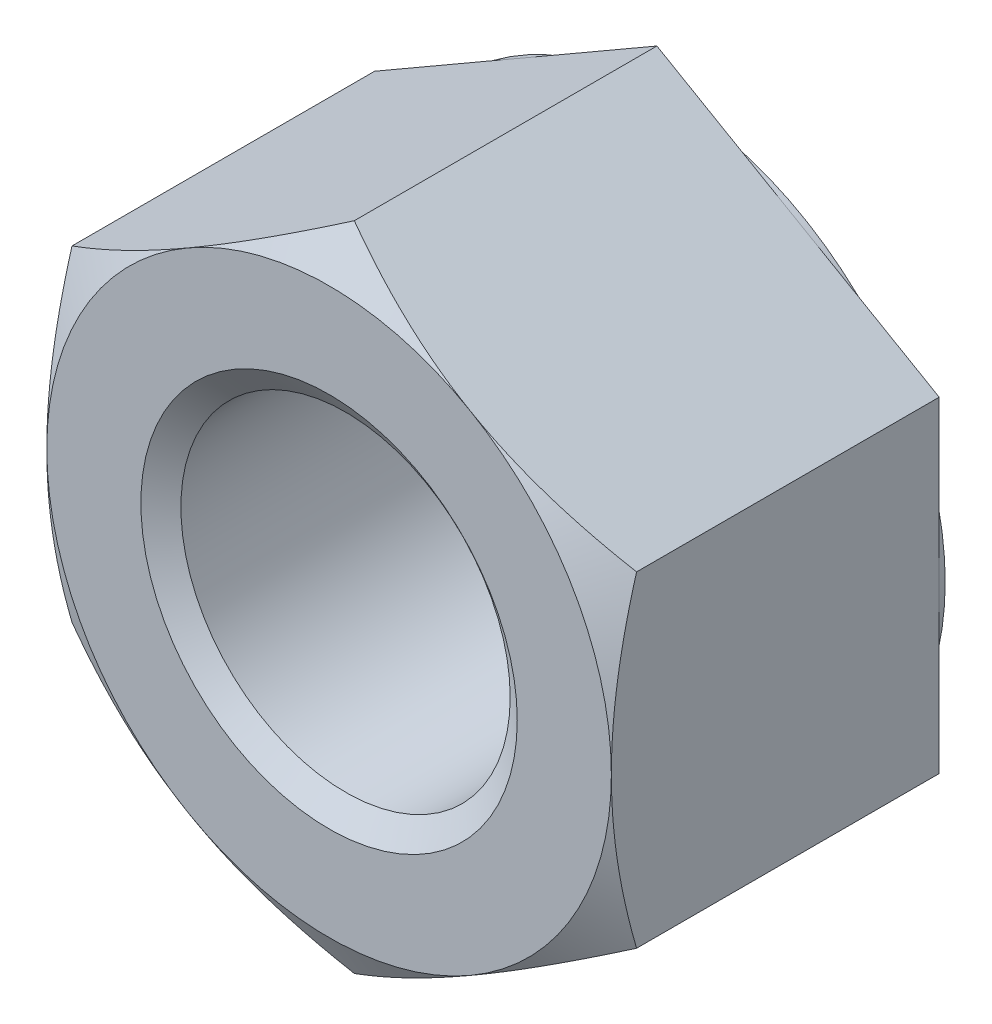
ISO-10303-21;
HEADER;
FILE_DESCRIPTION(('STEP AP214'),'2;1');
FILE_NAME('part.step','',(''),(''),'','','');
FILE_SCHEMA(('AUTOMOTIVE_DESIGN { 1 0 10303 214 1 1 1 1 }'));
ENDSEC;
DATA;
#1=APPLICATION_CONTEXT('core data for automotive mechanical design processes');
#2=APPLICATION_PROTOCOL_DEFINITION('international standard','automotive_design',2000,#1);
#3=PRODUCT_CONTEXT('',#1,'mechanical');
#4=PRODUCT('Part','Part','',(#3));
#5=PRODUCT_RELATED_PRODUCT_CATEGORY('part','',(#4));
#6=PRODUCT_DEFINITION_FORMATION('','',#4);
#7=PRODUCT_DEFINITION_CONTEXT('part definition',#1,'design');
#8=PRODUCT_DEFINITION('design','',#6,#7);
#9=PRODUCT_DEFINITION_SHAPE('','',#8);
#10=(LENGTH_UNIT() NAMED_UNIT(*) SI_UNIT(.MILLI.,.METRE.));
#11=(NAMED_UNIT(*) PLANE_ANGLE_UNIT() SI_UNIT($,.RADIAN.));
#12=(NAMED_UNIT(*) SI_UNIT($,.STERADIAN.) SOLID_ANGLE_UNIT());
#13=UNCERTAINTY_MEASURE_WITH_UNIT(LENGTH_MEASURE(1.E-05),#10,'distance_accuracy_value','');
#14=(GEOMETRIC_REPRESENTATION_CONTEXT(3) GLOBAL_UNCERTAINTY_ASSIGNED_CONTEXT((#13)) GLOBAL_UNIT_ASSIGNED_CONTEXT((#10,
#11,#12)) REPRESENTATION_CONTEXT('',''));
#15=CARTESIAN_POINT('',(0.,0.,0.));
#16=DIRECTION('',(0.,0.,1.));
#17=DIRECTION('',(1.,0.,0.));
#18=AXIS2_PLACEMENT_3D('',#15,#16,#17);
#19=CARTESIAN_POINT('',(0.,0.,-22.5298));
#20=DIRECTION('',(0.,0.,1.));
#21=DIRECTION('',(1.,0.,0.));
#22=AXIS2_PLACEMENT_3D('',#19,#20,#21);
#23=CYLINDRICAL_SURFACE('',#22,11.1125);
#24=CARTESIAN_POINT('',(0.,0.,-1.11157946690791));
#25=DIRECTION('',(0.,0.,1.));
#26=DIRECTION('',(1.,0.,0.));
#27=AXIS2_PLACEMENT_3D('',#24,#25,#26);
#28=CIRCLE('',#27,11.1125);
#29=CARTESIAN_POINT('',(11.1125,0.,-1.11157946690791));
#30=VERTEX_POINT('',#29);
#31=EDGE_CURVE('E157',#30,#30,#28,.F.);
#32=ORIENTED_EDGE('',*,*,#31,.F.);
#33=EDGE_LOOP('',(#32));
#34=FACE_BOUND('',#33,.T.);
#35=CARTESIAN_POINT('',(0.,0.,-21.3928205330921));
#36=DIRECTION('',(0.,0.,-1.));
#37=DIRECTION('',(-1.,0.,0.));
#38=AXIS2_PLACEMENT_3D('',#35,#36,#37);
#39=CIRCLE('',#38,11.1125);
#40=CARTESIAN_POINT('',(-11.1125,0.,-21.3928205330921));
#41=VERTEX_POINT('',#40);
#42=EDGE_CURVE('E46',#41,#41,#39,.F.);
#43=ORIENTED_EDGE('',*,*,#42,.F.);
#44=EDGE_LOOP('',(#43));
#45=FACE_BOUND('',#44,.T.);
#46=ADVANCED_FACE('F41',(#34,#45),#23,.F.);
#47=CARTESIAN_POINT('',(0.,21.9970452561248,-22.5298));
#48=DIRECTION('',(-0.500000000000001,0.866025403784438,0.));
#49=DIRECTION('',(-0.866025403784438,-0.500000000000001,0.));
#50=AXIS2_PLACEMENT_3D('',#47,#48,#49);
#51=PLANE('',#50);
#52=DIRECTION('',(0.,0.,1.));
#53=VECTOR('',#52,1.);
#54=CARTESIAN_POINT('',(-19.05,10.9985226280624,-22.5298));
#55=LINE('',#54,#53);
#56=CARTESIAN_POINT('',(-19.05,10.9985226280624,-22.1234));
#57=VERTEX_POINT('',#56);
#58=CARTESIAN_POINT('',(-19.05,10.9985226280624,-1.70147737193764));
#59=VERTEX_POINT('',#58);
#60=EDGE_CURVE('E300',#57,#59,#55,.T.);
#61=ORIENTED_EDGE('',*,*,#60,.T.);
#62=CARTESIAN_POINT('',(-19.0502,10.9984071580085,-1.70154403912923));
#63=CARTESIAN_POINT('',(-18.6314889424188,11.2401500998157,-1.56198341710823));
#64=CARTESIAN_POINT('',(-18.2111446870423,11.4828359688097,-1.42875584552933));
#65=CARTESIAN_POINT('',(-17.3670855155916,11.9701537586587,-1.17672716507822));
#66=CARTESIAN_POINT('',(-16.9433695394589,12.2147862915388,-1.05793080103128));
#67=CARTESIAN_POINT('',(-16.0917480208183,12.7064702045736,-0.836361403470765));
#68=CARTESIAN_POINT('',(-15.6638350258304,12.9535258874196,-0.733626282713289));
#69=CARTESIAN_POINT('',(-14.8050356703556,13.4493539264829,-0.546385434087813));
#70=CARTESIAN_POINT('',(-14.374149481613,13.6981261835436,-0.461878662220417));
#71=CARTESIAN_POINT('',(-13.5204444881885,14.1910129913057,-0.31468882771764));
#72=CARTESIAN_POINT('',(-13.0976890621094,14.4350909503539,-0.251518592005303));
#73=CARTESIAN_POINT('',(-12.250241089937,14.9243652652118,-0.145596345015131));
#74=CARTESIAN_POINT('',(-11.8255485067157,15.1695616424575,-0.102844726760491));
#75=CARTESIAN_POINT('',(-10.9754499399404,15.6603662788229,-0.0388391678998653));
#76=CARTESIAN_POINT('',(-10.5500454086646,15.9059736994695,-0.017559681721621));
#77=CARTESIAN_POINT('',(-9.6988436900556,16.397415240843,0.00304398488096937));
#78=CARTESIAN_POINT('',(-9.27304651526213,16.6432493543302,0.00236884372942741));
#79=CARTESIAN_POINT('',(-8.47700964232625,17.1028414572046,-0.0194033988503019));
#80=CARTESIAN_POINT('',(-8.10671322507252,17.316632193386,-0.0378455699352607));
#81=CARTESIAN_POINT('',(-7.36700369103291,17.7437036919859,-0.0909844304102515));
#82=CARTESIAN_POINT('',(-6.99759056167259,17.9569844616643,-0.125680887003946));
#83=CARTESIAN_POINT('',(-6.25978756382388,18.3829552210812,-0.210726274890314));
#84=CARTESIAN_POINT('',(-5.89139892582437,18.5956445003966,-0.261089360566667));
#85=CARTESIAN_POINT('',(-5.15637533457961,19.0200105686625,-0.376579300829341));
#86=CARTESIAN_POINT('',(-4.78974037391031,19.2316873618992,-0.441706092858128));
#87=CARTESIAN_POINT('',(-3.6767727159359,19.8742595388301,-0.660888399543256));
#88=CARTESIAN_POINT('',(-2.93366305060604,20.3032941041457,-0.836799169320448));
#89=CARTESIAN_POINT('',(-1.45852420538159,21.1549659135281,-1.23604434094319));
#90=CARTESIAN_POINT('',(-0.726476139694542,21.5776140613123,-1.45928498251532));
#91=CARTESIAN_POINT('',(0.000199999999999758,21.9971607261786,-1.70154403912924));
#92=B_SPLINE_CURVE_WITH_KNOTS('',3,(#62,#63,#64,#65,#66,#67,#68,#69,#70,#71,#72,#73,#74,#75,#76,
#77,#78,#79,#80,#81,#82,#83,#84,#85,#86,#87,#88,#89,#90,#91),.UNSPECIFIED.,.F.,.F.,(4,2,2,2,2,2,
2,2,2,2,2,2,2,2,4),(0.,1.50971559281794,3.01992622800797,4.53364959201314,6.04728623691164,
7.52356313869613,8.99986845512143,10.4744153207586,11.9489166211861,13.2325441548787,
14.5161533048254,15.8009255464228,17.085692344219,19.7118183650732,22.3327898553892),.UNSPECIFIED.);
#93=CARTESIAN_POINT('',(-9.52500000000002,16.4977839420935,0.));
#94=VERTEX_POINT('',#93);
#95=EDGE_CURVE('E144',#59,#94,#92,.T.);
#96=ORIENTED_EDGE('',*,*,#95,.T.);
#97=CARTESIAN_POINT('',(0.,21.9970452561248,-1.70147737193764));
#98=VERTEX_POINT('',#97);
#99=EDGE_CURVE('E171',#94,#98,#92,.T.);
#100=ORIENTED_EDGE('',*,*,#99,.T.);
#101=DIRECTION('',(0.,0.,1.));
#102=VECTOR('',#101,1.);
#103=CARTESIAN_POINT('',(0.,21.9970452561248,-22.5298));
#104=LINE('',#103,#102);
#105=CARTESIAN_POINT('',(0.,21.9970452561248,-22.1234));
#106=VERTEX_POINT('',#105);
#107=EDGE_CURVE('E281',#106,#98,#104,.T.);
#108=ORIENTED_EDGE('',*,*,#107,.F.);
#109=DIRECTION('',(-0.866025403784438,-0.500000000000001,0.));
#110=VECTOR('',#109,1.);
#111=CARTESIAN_POINT('',(0.,21.9970452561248,-22.1234));
#112=LINE('',#111,#110);
#113=CARTESIAN_POINT('',(-9.52500000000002,16.4977839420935,-22.1234));
#114=VERTEX_POINT('',#113);
#115=EDGE_CURVE('E271',#106,#114,#112,.T.);
#116=ORIENTED_EDGE('',*,*,#115,.T.);
#117=EDGE_CURVE('E268',#114,#57,#112,.T.);
#118=ORIENTED_EDGE('',*,*,#117,.T.);
#119=EDGE_LOOP('',(#61,#96,#100,#108,#116,#118));
#120=FACE_BOUND('',#119,.T.);
#121=ADVANCED_FACE('F43',(#120),#51,.T.);
#122=CARTESIAN_POINT('',(19.05,10.9985226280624,-22.5298));
#123=DIRECTION('',(0.500000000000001,0.866025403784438,0.));
#124=DIRECTION('',(-0.866025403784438,0.500000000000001,0.));
#125=AXIS2_PLACEMENT_3D('',#122,#123,#124);
#126=PLANE('',#125);
#127=ORIENTED_EDGE('',*,*,#107,.T.);
#128=CARTESIAN_POINT('',(-0.000200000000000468,21.9971607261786,-1.70154403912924));
#129=CARTESIAN_POINT('',(0.418511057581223,21.7554177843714,-1.56198341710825));
#130=CARTESIAN_POINT('',(0.83885531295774,21.5127319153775,-1.42875584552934));
#131=CARTESIAN_POINT('',(1.68291448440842,21.0254141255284,-1.17672716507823));
#132=CARTESIAN_POINT('',(2.10663046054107,20.7807815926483,-1.05793080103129));
#133=CARTESIAN_POINT('',(2.95825197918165,20.2890976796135,-0.836361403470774));
#134=CARTESIAN_POINT('',(3.38616497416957,20.0420419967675,-0.733626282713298));
#135=CARTESIAN_POINT('',(4.24496432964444,19.5462139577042,-0.546385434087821));
#136=CARTESIAN_POINT('',(4.67585051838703,19.2974417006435,-0.461878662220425));
#137=CARTESIAN_POINT('',(5.52955551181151,18.8045548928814,-0.314688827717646));
#138=CARTESIAN_POINT('',(5.95231093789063,18.5604769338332,-0.251518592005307));
#139=CARTESIAN_POINT('',(6.79975891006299,18.0712026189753,-0.145596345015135));
#140=CARTESIAN_POINT('',(7.22445149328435,17.8260062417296,-0.102844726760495));
#141=CARTESIAN_POINT('',(8.07455006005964,17.3352016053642,-0.0388391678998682));
#142=CARTESIAN_POINT('',(8.49995459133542,17.0895941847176,-0.0175596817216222));
#143=CARTESIAN_POINT('',(9.35115630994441,16.5981526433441,0.00304398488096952));
#144=CARTESIAN_POINT('',(9.77695348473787,16.3523185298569,0.00236884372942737));
#145=CARTESIAN_POINT('',(10.5729903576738,15.8927264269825,-0.0194033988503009));
#146=CARTESIAN_POINT('',(10.9432867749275,15.6789356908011,-0.0378455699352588));
#147=CARTESIAN_POINT('',(11.6829963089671,15.2518641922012,-0.0909844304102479));
#148=CARTESIAN_POINT('',(12.0524094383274,15.0385834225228,-0.125680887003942));
#149=CARTESIAN_POINT('',(12.7902124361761,14.612612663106,-0.21072627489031));
#150=CARTESIAN_POINT('',(13.1586010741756,14.3999233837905,-0.261089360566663));
#151=CARTESIAN_POINT('',(13.8936246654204,13.9755573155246,-0.376579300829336));
#152=CARTESIAN_POINT('',(14.2602596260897,13.7638805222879,-0.441706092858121));
#153=CARTESIAN_POINT('',(15.3732272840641,13.121308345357,-0.660888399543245));
#154=CARTESIAN_POINT('',(16.116336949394,12.6922737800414,-0.836799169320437));
#155=CARTESIAN_POINT('',(17.5914757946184,11.840601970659,-1.23604434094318));
#156=CARTESIAN_POINT('',(18.3235238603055,11.4179538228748,-1.45928498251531));
#157=CARTESIAN_POINT('',(19.0502,10.9984071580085,-1.70154403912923));
#158=B_SPLINE_CURVE_WITH_KNOTS('',3,(#128,#129,#130,#131,#132,#133,#134,#135,#136,#137,#138,
#139,#140,#141,#142,#143,#144,#145,#146,#147,#148,#149,#150,#151,#152,#153,#154,#155,#156,#157),
.UNSPECIFIED.,.F.,.F.,(4,2,2,2,2,2,2,2,2,2,2,2,2,2,4),(0.,1.50971559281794,3.01992622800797,
4.53364959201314,6.04728623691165,7.52356313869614,8.99986845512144,10.4744153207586,
11.9489166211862,13.2325441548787,14.5161533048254,15.8009255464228,17.085692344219,
19.7118183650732,22.3327898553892),.UNSPECIFIED.);
#159=CARTESIAN_POINT('',(9.52500000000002,16.4977839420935,0.));
#160=VERTEX_POINT('',#159);
#161=EDGE_CURVE('E170',#98,#160,#158,.T.);
#162=ORIENTED_EDGE('',*,*,#161,.T.);
#163=CARTESIAN_POINT('',(19.05,10.9985226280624,-1.70147737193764));
#164=VERTEX_POINT('',#163);
#165=EDGE_CURVE('E152',#160,#164,#158,.T.);
#166=ORIENTED_EDGE('',*,*,#165,.T.);
#167=DIRECTION('',(0.,0.,1.));
#168=VECTOR('',#167,1.);
#169=CARTESIAN_POINT('',(19.05,10.9985226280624,-22.5298));
#170=LINE('',#169,#168);
#171=CARTESIAN_POINT('',(19.05,10.9985226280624,-22.1234));
#172=VERTEX_POINT('',#171);
#173=EDGE_CURVE('E168',#172,#164,#170,.T.);
#174=ORIENTED_EDGE('',*,*,#173,.F.);
#175=DIRECTION('',(-0.866025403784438,0.500000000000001,0.));
#176=VECTOR('',#175,1.);
#177=CARTESIAN_POINT('',(19.05,10.9985226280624,-22.1234));
#178=LINE('',#177,#176);
#179=CARTESIAN_POINT('',(9.52500000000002,16.4977839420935,-22.1234));
#180=VERTEX_POINT('',#179);
#181=EDGE_CURVE('E283',#172,#180,#178,.T.);
#182=ORIENTED_EDGE('',*,*,#181,.T.);
#183=EDGE_CURVE('E279',#180,#106,#178,.T.);
#184=ORIENTED_EDGE('',*,*,#183,.T.);
#185=EDGE_LOOP('',(#127,#162,#166,#174,#182,#184));
#186=FACE_BOUND('',#185,.T.);
#187=ADVANCED_FACE('F242',(#186),#126,.T.);
#188=CARTESIAN_POINT('',(19.05,10.9985226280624,-22.5298));
#189=DIRECTION('',(-1.,0.,0.));
#190=DIRECTION('',(0.,0.,1.));
#191=AXIS2_PLACEMENT_3D('',#188,#189,#190);
#192=PLANE('',#191);
#193=CARTESIAN_POINT('',(19.05,-29.169702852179,-9.1159337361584));
#194=CARTESIAN_POINT('',(19.05,-28.7515170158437,-8.91378890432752));
#195=CARTESIAN_POINT('',(19.05,-28.3328257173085,-8.71269026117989));
#196=CARTESIAN_POINT('',(19.05,-27.494325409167,-8.31282549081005));
#197=CARTESIAN_POINT('',(19.05,-27.0745163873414,-8.11405938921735));
#198=CARTESIAN_POINT('',(19.05,-25.813129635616,-7.52156252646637));
#199=CARTESIAN_POINT('',(19.05,-24.9697281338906,-7.1316990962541));
#200=CARTESIAN_POINT('',(19.05,-23.2722707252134,-6.36257122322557));
#201=CARTESIAN_POINT('',(19.05,-22.4181814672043,-5.98338020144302));
#202=CARTESIAN_POINT('',(19.05,-20.7029839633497,-5.24127883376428));
#203=CARTESIAN_POINT('',(19.05,-19.8418760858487,-4.87836763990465));
#204=CARTESIAN_POINT('',(19.05,-18.1005821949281,-4.16885698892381));
#205=CARTESIAN_POINT('',(19.05,-17.2202917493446,-3.82251248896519));
#206=CARTESIAN_POINT('',(19.05,-15.4493217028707,-3.15694792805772));
#207=CARTESIAN_POINT('',(19.05,-14.5586409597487,-2.83773088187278));
#208=CARTESIAN_POINT('',(19.05,-12.7673320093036,-2.2350028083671));
#209=CARTESIAN_POINT('',(19.05,-11.8667295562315,-1.95141586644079));
#210=CARTESIAN_POINT('',(19.05,-10.0526343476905,-1.42914392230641));
#211=CARTESIAN_POINT('',(19.05,-9.13914576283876,-1.19044473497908));
#212=CARTESIAN_POINT('',(19.05,-7.75907469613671,-0.874799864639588));
#213=CARTESIAN_POINT('',(19.05,-7.29731333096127,-0.776636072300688));
#214=CARTESIAN_POINT('',(19.05,-6.37071732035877,-0.595993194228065));
#215=CARTESIAN_POINT('',(19.05,-5.90588274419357,-0.513513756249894));
#216=CARTESIAN_POINT('',(19.05,-4.97345228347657,-0.365701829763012));
#217=CARTESIAN_POINT('',(19.05,-4.50585623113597,-0.300370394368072));
#218=CARTESIAN_POINT('',(19.05,-3.56843861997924,-0.188166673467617));
#219=CARTESIAN_POINT('',(19.05,-3.09861705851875,-0.141294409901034));
#220=CARTESIAN_POINT('',(19.05,-2.16041609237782,-0.0672708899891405));
#221=CARTESIAN_POINT('',(19.05,-1.69204648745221,-0.0399962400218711));
#222=CARTESIAN_POINT('',(19.05,-0.754574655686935,-0.00531133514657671));
#223=CARTESIAN_POINT('',(19.05,-0.285472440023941,0.0020992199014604));
#224=CARTESIAN_POINT('',(19.05,0.652492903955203,-0.00311981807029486));
#225=CARTESIAN_POINT('',(19.05,1.12135606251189,-0.0157438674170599));
#226=CARTESIAN_POINT('',(19.05,2.05813737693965,-0.0607182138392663));
#227=CARTESIAN_POINT('',(19.05,2.52605549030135,-0.0930693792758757));
#228=CARTESIAN_POINT('',(19.05,3.65980250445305,-0.19468009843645));
#229=CARTESIAN_POINT('',(19.05,4.32476458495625,-0.273803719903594));
#230=CARTESIAN_POINT('',(19.05,5.64947952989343,-0.467485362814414));
#231=CARTESIAN_POINT('',(19.05,6.30923160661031,-0.582048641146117));
#232=CARTESIAN_POINT('',(19.05,8.28182382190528,-0.973151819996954));
#233=CARTESIAN_POINT('',(19.05,9.58542312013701,-1.29684470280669));
#234=CARTESIAN_POINT('',(19.05,11.5353898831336,-1.85499845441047));
#235=CARTESIAN_POINT('',(19.05,12.191945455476,-2.05588340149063));
#236=CARTESIAN_POINT('',(19.05,13.498713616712,-2.47768236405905));
#237=CARTESIAN_POINT('',(19.05,14.1489256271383,-2.69859818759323));
#238=CARTESIAN_POINT('',(19.05,15.4397656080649,-3.15575174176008));
#239=CARTESIAN_POINT('',(19.05,16.0804269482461,-3.39189604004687));
#240=CARTESIAN_POINT('',(19.05,17.0373840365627,-3.75633654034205));
#241=CARTESIAN_POINT('',(19.05,17.3556458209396,-3.87949985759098));
#242=CARTESIAN_POINT('',(19.05,17.9909330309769,-4.12895791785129));
#243=CARTESIAN_POINT('',(19.05,18.3079584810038,-4.25525259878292));
#244=CARTESIAN_POINT('',(19.05,18.6244086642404,-4.38297164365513));
#245=B_SPLINE_CURVE_WITH_KNOTS('',3,(#193,#194,#195,#196,#197,#198,#199,#200,#201,#202,#203,
#204,#205,#206,#207,#208,#209,#210,#211,#212,#213,#214,#215,#216,#217,#218,#219,#220,#221,#222,
#223,#224,#225,#226,#227,#228,#229,#230,#231,#232,#233,#234,#235,#236,#237,#238,#239,#240,#241,
#242,#243,#244),.UNSPECIFIED.,.F.,.F.,(4,2,2,2,2,2,2,2,2,2,2,2,2,2,2,2,2,2,2,2,2,2,2,2,2,4),(0.,
1.39343811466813,2.78689152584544,5.57425145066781,8.37756231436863,11.1807269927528,
14.0183059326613,16.856199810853,19.6879407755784,22.5187853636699,23.934802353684,
25.3507875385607,26.766859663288,28.1829334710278,29.5900111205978,30.9970675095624,
32.4037346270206,33.8104636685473,35.8182820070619,37.8263983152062,41.8503661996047,
43.9100054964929,45.9698308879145,48.0180400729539,49.0418117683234,50.0655631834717),.UNSPECIFIED.);
#246=CARTESIAN_POINT('',(19.05,-10.9985226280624,-1.70147737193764));
#247=VERTEX_POINT('',#246);
#248=CARTESIAN_POINT('',(19.05,0.,0.));
#249=VERTEX_POINT('',#248);
#250=EDGE_CURVE('E132',#247,#249,#245,.T.);
#251=ORIENTED_EDGE('',*,*,#250,.F.);
#252=DIRECTION('',(0.,0.,1.));
#253=VECTOR('',#252,1.);
#254=CARTESIAN_POINT('',(19.05,-10.9985226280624,-22.5298));
#255=LINE('',#254,#253);
#256=CARTESIAN_POINT('',(19.05,-10.9985226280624,-22.1234));
#257=VERTEX_POINT('',#256);
#258=EDGE_CURVE('E289',#257,#247,#255,.T.);
#259=ORIENTED_EDGE('',*,*,#258,.F.);
#260=DIRECTION('',(0.,-1.,0.));
#261=VECTOR('',#260,1.);
#262=CARTESIAN_POINT('',(19.05,10.9985226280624,-22.1234));
#263=LINE('',#262,#261);
#264=CARTESIAN_POINT('',(19.05,0.,-22.1234));
#265=VERTEX_POINT('',#264);
#266=EDGE_CURVE('E284',#265,#257,#263,.T.);
#267=ORIENTED_EDGE('',*,*,#266,.F.);
#268=EDGE_CURVE('E285',#172,#265,#263,.T.);
#269=ORIENTED_EDGE('',*,*,#268,.F.);
#270=ORIENTED_EDGE('',*,*,#173,.T.);
#271=EDGE_CURVE('E148',#249,#164,#245,.T.);
#272=ORIENTED_EDGE('',*,*,#271,.F.);
#273=EDGE_LOOP('',(#251,#259,#267,#269,#270,#272));
#274=FACE_BOUND('',#273,.T.);
#275=ADVANCED_FACE('F161',(#274),#192,.F.);
#276=CARTESIAN_POINT('',(0.,-21.9970452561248,-22.5298));
#277=DIRECTION('',(0.500000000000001,-0.866025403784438,0.));
#278=DIRECTION('',(0.866025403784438,0.500000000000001,0.));
#279=AXIS2_PLACEMENT_3D('',#276,#277,#278);
#280=PLANE('',#279);
#281=ORIENTED_EDGE('',*,*,#258,.T.);
#282=CARTESIAN_POINT('',(19.0502,-10.9984071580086,-1.70154403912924));
#283=CARTESIAN_POINT('',(18.6314889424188,-11.2401500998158,-1.56198341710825));
#284=CARTESIAN_POINT('',(18.2111446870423,-11.4828359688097,-1.42875584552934));
#285=CARTESIAN_POINT('',(17.3670855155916,-11.9701537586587,-1.17672716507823));
#286=CARTESIAN_POINT('',(16.9433695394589,-12.2147862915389,-1.05793080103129));
#287=CARTESIAN_POINT('',(16.0917480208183,-12.7064702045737,-0.836361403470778));
#288=CARTESIAN_POINT('',(15.6638350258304,-12.9535258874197,-0.733626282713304));
#289=CARTESIAN_POINT('',(14.8050356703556,-13.449353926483,-0.546385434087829));
#290=CARTESIAN_POINT('',(14.374149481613,-13.6981261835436,-0.461878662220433));
#291=CARTESIAN_POINT('',(13.5204444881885,-14.1910129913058,-0.314688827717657));
#292=CARTESIAN_POINT('',(13.0976890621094,-14.4350909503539,-0.25151859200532));
#293=CARTESIAN_POINT('',(12.250241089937,-14.9243652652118,-0.145596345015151));
#294=CARTESIAN_POINT('',(11.8255485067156,-15.1695616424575,-0.102844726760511));
#295=CARTESIAN_POINT('',(10.9754499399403,-15.660366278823,-0.0388391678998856));
#296=CARTESIAN_POINT('',(10.5500454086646,-15.9059736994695,-0.0175596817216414));
#297=CARTESIAN_POINT('',(9.69884369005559,-16.3974152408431,0.00304398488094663));
#298=CARTESIAN_POINT('',(9.27304651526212,-16.6432493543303,0.00236884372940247));
#299=CARTESIAN_POINT('',(8.47700964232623,-17.1028414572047,-0.019403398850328));
#300=CARTESIAN_POINT('',(8.10671322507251,-17.3166321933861,-0.0378455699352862));
#301=CARTESIAN_POINT('',(7.36700369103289,-17.743703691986,-0.0909844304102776));
#302=CARTESIAN_POINT('',(6.99759056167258,-17.9569844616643,-0.125680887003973));
#303=CARTESIAN_POINT('',(6.25978756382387,-18.3829552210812,-0.210726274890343));
#304=CARTESIAN_POINT('',(5.89139892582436,-18.5956445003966,-0.261089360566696));
#305=CARTESIAN_POINT('',(5.1563753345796,-19.0200105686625,-0.37657930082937));
#306=CARTESIAN_POINT('',(4.7897403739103,-19.2316873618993,-0.441706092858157));
#307=CARTESIAN_POINT('',(3.67677271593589,-19.8742595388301,-0.660888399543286));
#308=CARTESIAN_POINT('',(2.93366305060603,-20.3032941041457,-0.836799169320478));
#309=CARTESIAN_POINT('',(1.45852420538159,-21.1549659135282,-1.23604434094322));
#310=CARTESIAN_POINT('',(0.72647613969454,-21.5776140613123,-1.45928498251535));
#311=CARTESIAN_POINT('',(-0.000200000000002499,-21.9971607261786,-1.70154403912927));
#312=B_SPLINE_CURVE_WITH_KNOTS('',3,(#282,#283,#284,#285,#286,#287,#288,#289,#290,#291,#292,
#293,#294,#295,#296,#297,#298,#299,#300,#301,#302,#303,#304,#305,#306,#307,#308,#309,#310,#311),
.UNSPECIFIED.,.F.,.F.,(4,2,2,2,2,2,2,2,2,2,2,2,2,2,4),(0.,1.50971559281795,3.01992622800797,
4.53364959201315,6.04728623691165,7.52356313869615,8.99986845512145,10.4744153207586,
11.9489166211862,13.2325441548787,14.5161533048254,15.8009255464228,17.085692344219,
19.7118183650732,22.3327898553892),.UNSPECIFIED.);
#313=CARTESIAN_POINT('',(9.52500000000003,-16.4977839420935,0.));
#314=VERTEX_POINT('',#313);
#315=EDGE_CURVE('E138',#247,#314,#312,.T.);
#316=ORIENTED_EDGE('',*,*,#315,.T.);
#317=CARTESIAN_POINT('',(0.,-21.9970452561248,-1.70147737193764));
#318=VERTEX_POINT('',#317);
#319=EDGE_CURVE('E58',#314,#318,#312,.T.);
#320=ORIENTED_EDGE('',*,*,#319,.T.);
#321=DIRECTION('',(0.,0.,1.));
#322=VECTOR('',#321,1.);
#323=CARTESIAN_POINT('',(0.,-21.9970452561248,-22.5298));
#324=LINE('',#323,#322);
#325=CARTESIAN_POINT('',(0.,-21.9970452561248,-22.1234));
#326=VERTEX_POINT('',#325);
#327=EDGE_CURVE('E292',#326,#318,#324,.T.);
#328=ORIENTED_EDGE('',*,*,#327,.F.);
#329=DIRECTION('',(0.866025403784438,0.500000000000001,0.));
#330=VECTOR('',#329,1.);
#331=CARTESIAN_POINT('',(0.,-21.9970452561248,-22.1234));
#332=LINE('',#331,#330);
#333=CARTESIAN_POINT('',(9.52500000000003,-16.4977839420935,-22.1234));
#334=VERTEX_POINT('',#333);
#335=EDGE_CURVE('E274',#326,#334,#332,.T.);
#336=ORIENTED_EDGE('',*,*,#335,.T.);
#337=EDGE_CURVE('E277',#334,#257,#332,.T.);
#338=ORIENTED_EDGE('',*,*,#337,.T.);
#339=EDGE_LOOP('',(#281,#316,#320,#328,#336,#338));
#340=FACE_BOUND('',#339,.T.);
#341=ADVANCED_FACE('F223',(#340),#280,.T.);
#342=CARTESIAN_POINT('',(-19.05,-10.9985226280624,-22.5298));
#343=DIRECTION('',(-0.500000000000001,-0.866025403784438,0.));
#344=DIRECTION('',(0.866025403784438,-0.500000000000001,0.));
#345=AXIS2_PLACEMENT_3D('',#342,#343,#344);
#346=PLANE('',#345);
#347=ORIENTED_EDGE('',*,*,#327,.T.);
#348=CARTESIAN_POINT('',(0.000199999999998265,-21.9971607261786,-1.70154403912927));
#349=CARTESIAN_POINT('',(-0.418511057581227,-21.7554177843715,-1.56198341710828));
#350=CARTESIAN_POINT('',(-0.838855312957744,-21.5127319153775,-1.42875584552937));
#351=CARTESIAN_POINT('',(-1.68291448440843,-21.0254141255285,-1.17672716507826));
#352=CARTESIAN_POINT('',(-2.10663046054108,-20.7807815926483,-1.05793080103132));
#353=CARTESIAN_POINT('',(-2.95825197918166,-20.2890976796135,-0.836361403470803));
#354=CARTESIAN_POINT('',(-3.38616497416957,-20.0420419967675,-0.733626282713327));
#355=CARTESIAN_POINT('',(-4.24496432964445,-19.5462139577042,-0.546385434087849));
#356=CARTESIAN_POINT('',(-4.67585051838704,-19.2974417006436,-0.461878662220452));
#357=CARTESIAN_POINT('',(-5.52955551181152,-18.8045548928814,-0.314688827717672));
#358=CARTESIAN_POINT('',(-5.95231093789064,-18.5604769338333,-0.251518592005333));
#359=CARTESIAN_POINT('',(-6.79975891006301,-18.0712026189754,-0.145596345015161));
#360=CARTESIAN_POINT('',(-7.22445149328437,-17.8260062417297,-0.10284472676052));
#361=CARTESIAN_POINT('',(-8.07455006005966,-17.3352016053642,-0.0388391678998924));
#362=CARTESIAN_POINT('',(-8.49995459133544,-17.0895941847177,-0.0175596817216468));
#363=CARTESIAN_POINT('',(-9.35115630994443,-16.5981526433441,0.00304398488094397));
#364=CARTESIAN_POINT('',(-9.7769534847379,-16.3523185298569,0.00236884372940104));
#365=CARTESIAN_POINT('',(-10.5729903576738,-15.8927264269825,-0.0194033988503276));
#366=CARTESIAN_POINT('',(-10.9432867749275,-15.6789356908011,-0.037845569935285));
#367=CARTESIAN_POINT('',(-11.6829963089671,-15.2518641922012,-0.0909844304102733));
#368=CARTESIAN_POINT('',(-12.0524094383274,-15.0385834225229,-0.125680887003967));
#369=CARTESIAN_POINT('',(-12.7902124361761,-14.612612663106,-0.210726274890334));
#370=CARTESIAN_POINT('',(-13.1586010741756,-14.3999233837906,-0.261089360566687));
#371=CARTESIAN_POINT('',(-13.8936246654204,-13.9755573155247,-0.376579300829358));
#372=CARTESIAN_POINT('',(-14.2602596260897,-13.7638805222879,-0.441706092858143));
#373=CARTESIAN_POINT('',(-15.3732272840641,-13.1213083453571,-0.660888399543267));
#374=CARTESIAN_POINT('',(-16.116336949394,-12.6922737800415,-0.836799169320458));
#375=CARTESIAN_POINT('',(-17.5914757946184,-11.840601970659,-1.2360443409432));
#376=CARTESIAN_POINT('',(-18.3235238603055,-11.4179538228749,-1.45928498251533));
#377=CARTESIAN_POINT('',(-19.0502,-10.9984071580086,-1.70154403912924));
#378=B_SPLINE_CURVE_WITH_KNOTS('',3,(#348,#349,#350,#351,#352,#353,#354,#355,#356,#357,#358,
#359,#360,#361,#362,#363,#364,#365,#366,#367,#368,#369,#370,#371,#372,#373,#374,#375,#376,#377),
.UNSPECIFIED.,.F.,.F.,(4,2,2,2,2,2,2,2,2,2,2,2,2,2,4),(0.,1.50971559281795,3.01992622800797,
4.53364959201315,6.04728623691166,7.52356313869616,8.99986845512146,10.4744153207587,
11.9489166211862,13.2325441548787,14.5161533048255,15.8009255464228,17.085692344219,
19.7118183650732,22.3327898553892),.UNSPECIFIED.);
#379=CARTESIAN_POINT('',(-9.52500000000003,-16.4977839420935,0.));
#380=VERTEX_POINT('',#379);
#381=EDGE_CURVE('E217',#318,#380,#378,.T.);
#382=ORIENTED_EDGE('',*,*,#381,.T.);
#383=CARTESIAN_POINT('',(-19.05,-10.9985226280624,-1.70147737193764));
#384=VERTEX_POINT('',#383);
#385=EDGE_CURVE('E69',#380,#384,#378,.T.);
#386=ORIENTED_EDGE('',*,*,#385,.T.);
#387=DIRECTION('',(0.,0.,1.));
#388=VECTOR('',#387,1.);
#389=CARTESIAN_POINT('',(-19.05,-10.9985226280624,-22.5298));
#390=LINE('',#389,#388);
#391=CARTESIAN_POINT('',(-19.05,-10.9985226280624,-22.1234));
#392=VERTEX_POINT('',#391);
#393=EDGE_CURVE('E294',#392,#384,#390,.T.);
#394=ORIENTED_EDGE('',*,*,#393,.F.);
#395=DIRECTION('',(0.866025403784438,-0.500000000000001,0.));
#396=VECTOR('',#395,1.);
#397=CARTESIAN_POINT('',(-19.05,-10.9985226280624,-22.1234));
#398=LINE('',#397,#396);
#399=CARTESIAN_POINT('',(-9.52500000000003,-16.4977839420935,-22.1234));
#400=VERTEX_POINT('',#399);
#401=EDGE_CURVE('E265',#392,#400,#398,.T.);
#402=ORIENTED_EDGE('',*,*,#401,.T.);
#403=EDGE_CURVE('E269',#400,#326,#398,.T.);
#404=ORIENTED_EDGE('',*,*,#403,.T.);
#405=EDGE_LOOP('',(#347,#382,#386,#394,#402,#404));
#406=FACE_BOUND('',#405,.T.);
#407=ADVANCED_FACE('F216',(#406),#346,.T.);
#408=CARTESIAN_POINT('',(-19.05,10.9985226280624,-22.5298));
#409=DIRECTION('',(-1.,0.,0.));
#410=DIRECTION('',(0.,0.,1.));
#411=AXIS2_PLACEMENT_3D('',#408,#409,#410);
#412=PLANE('',#411);
#413=ORIENTED_EDGE('',*,*,#393,.T.);
#414=CARTESIAN_POINT('',(-19.05,-29.169702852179,-9.1159337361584));
#415=CARTESIAN_POINT('',(-19.05,-28.7515170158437,-8.91378890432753));
#416=CARTESIAN_POINT('',(-19.05,-28.3328257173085,-8.71269026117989));
#417=CARTESIAN_POINT('',(-19.05,-27.494325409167,-8.31282549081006));
#418=CARTESIAN_POINT('',(-19.05,-27.0745163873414,-8.11405938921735));
#419=CARTESIAN_POINT('',(-19.05,-25.813129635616,-7.52156252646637));
#420=CARTESIAN_POINT('',(-19.05,-24.9697281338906,-7.1316990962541));
#421=CARTESIAN_POINT('',(-19.05,-23.2722707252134,-6.36257122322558));
#422=CARTESIAN_POINT('',(-19.05,-22.4181814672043,-5.98338020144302));
#423=CARTESIAN_POINT('',(-19.05,-20.7029839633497,-5.24127883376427));
#424=CARTESIAN_POINT('',(-19.05,-19.8418760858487,-4.87836763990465));
#425=CARTESIAN_POINT('',(-19.05,-18.1005821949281,-4.16885698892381));
#426=CARTESIAN_POINT('',(-19.05,-17.2202917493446,-3.82251248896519));
#427=CARTESIAN_POINT('',(-19.05,-15.4493217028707,-3.15694792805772));
#428=CARTESIAN_POINT('',(-19.05,-14.5586409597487,-2.83773088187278));
#429=CARTESIAN_POINT('',(-19.05,-12.7673320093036,-2.2350028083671));
#430=CARTESIAN_POINT('',(-19.05,-11.8667295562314,-1.95141586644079));
#431=CARTESIAN_POINT('',(-19.05,-10.0526343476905,-1.42914392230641));
#432=CARTESIAN_POINT('',(-19.05,-9.13914576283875,-1.19044473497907));
#433=CARTESIAN_POINT('',(-19.05,-7.7590746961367,-0.874799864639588));
#434=CARTESIAN_POINT('',(-19.05,-7.29731333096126,-0.776636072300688));
#435=CARTESIAN_POINT('',(-19.05,-6.37071732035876,-0.595993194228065));
#436=CARTESIAN_POINT('',(-19.05,-5.90588274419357,-0.513513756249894));
#437=CARTESIAN_POINT('',(-19.05,-4.97345228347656,-0.365701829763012));
#438=CARTESIAN_POINT('',(-19.05,-4.50585623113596,-0.300370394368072));
#439=CARTESIAN_POINT('',(-19.05,-3.56843861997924,-0.188166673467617));
#440=CARTESIAN_POINT('',(-19.05,-3.09861705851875,-0.141294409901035));
#441=CARTESIAN_POINT('',(-19.05,-2.16041609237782,-0.0672708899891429));
#442=CARTESIAN_POINT('',(-19.05,-1.69204648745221,-0.0399962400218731));
#443=CARTESIAN_POINT('',(-19.05,-0.754574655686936,-0.00531133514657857));
#444=CARTESIAN_POINT('',(-19.05,-0.285472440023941,0.00209921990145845));
#445=CARTESIAN_POINT('',(-19.05,0.652492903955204,-0.00311981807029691));
#446=CARTESIAN_POINT('',(-19.05,1.12135606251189,-0.015743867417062));
#447=CARTESIAN_POINT('',(-19.05,2.05813737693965,-0.0607182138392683));
#448=CARTESIAN_POINT('',(-19.05,2.52605549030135,-0.0930693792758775));
#449=CARTESIAN_POINT('',(-19.05,3.65980250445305,-0.194680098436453));
#450=CARTESIAN_POINT('',(-19.05,4.32476458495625,-0.273803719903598));
#451=CARTESIAN_POINT('',(-19.05,5.64947952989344,-0.467485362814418));
#452=CARTESIAN_POINT('',(-19.05,6.30923160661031,-0.58204864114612));
#453=CARTESIAN_POINT('',(-19.05,8.28182382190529,-0.973151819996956));
#454=CARTESIAN_POINT('',(-19.05,9.58542312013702,-1.29684470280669));
#455=CARTESIAN_POINT('',(-19.05,11.5353898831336,-1.85499845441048));
#456=CARTESIAN_POINT('',(-19.05,12.191945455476,-2.05588340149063));
#457=CARTESIAN_POINT('',(-19.05,13.498713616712,-2.47768236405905));
#458=CARTESIAN_POINT('',(-19.05,14.1489256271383,-2.69859818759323));
#459=CARTESIAN_POINT('',(-19.05,15.4397656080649,-3.15575174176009));
#460=CARTESIAN_POINT('',(-19.05,16.0804269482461,-3.39189604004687));
#461=CARTESIAN_POINT('',(-19.05,17.0373840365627,-3.75633654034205));
#462=CARTESIAN_POINT('',(-19.05,17.3556458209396,-3.87949985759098));
#463=CARTESIAN_POINT('',(-19.05,17.9909330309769,-4.1289579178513));
#464=CARTESIAN_POINT('',(-19.05,18.3079584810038,-4.25525259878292));
#465=CARTESIAN_POINT('',(-19.05,18.6244086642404,-4.38297164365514));
#466=B_SPLINE_CURVE_WITH_KNOTS('',3,(#414,#415,#416,#417,#418,#419,#420,#421,#422,#423,#424,
#425,#426,#427,#428,#429,#430,#431,#432,#433,#434,#435,#436,#437,#438,#439,#440,#441,#442,#443,
#444,#445,#446,#447,#448,#449,#450,#451,#452,#453,#454,#455,#456,#457,#458,#459,#460,#461,#462,
#463,#464,#465),.UNSPECIFIED.,.F.,.F.,(4,2,2,2,2,2,2,2,2,2,2,2,2,2,2,2,2,2,2,2,2,2,2,2,2,4),(0.,
1.39343811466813,2.78689152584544,5.57425145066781,8.37756231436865,11.1807269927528,
14.0183059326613,16.856199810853,19.6879407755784,22.5187853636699,23.934802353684,
25.3507875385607,26.766859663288,28.1829334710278,29.5900111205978,30.9970675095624,
32.4037346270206,33.8104636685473,35.8182820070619,37.8263983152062,41.8503661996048,
43.910005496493,45.9698308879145,48.0180400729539,49.0418117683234,50.0655631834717),.UNSPECIFIED.);
#467=CARTESIAN_POINT('',(-19.05,0.,0.));
#468=VERTEX_POINT('',#467);
#469=EDGE_CURVE('E220',#384,#468,#466,.T.);
#470=ORIENTED_EDGE('',*,*,#469,.T.);
#471=EDGE_CURVE('E160',#468,#59,#466,.T.);
#472=ORIENTED_EDGE('',*,*,#471,.T.);
#473=ORIENTED_EDGE('',*,*,#60,.F.);
#474=DIRECTION('',(0.,-1.,0.));
#475=VECTOR('',#474,1.);
#476=CARTESIAN_POINT('',(-19.05,10.9985226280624,-22.1234));
#477=LINE('',#476,#475);
#478=CARTESIAN_POINT('',(-19.05,0.,-22.1234));
#479=VERTEX_POINT('',#478);
#480=EDGE_CURVE('E302',#57,#479,#477,.T.);
#481=ORIENTED_EDGE('',*,*,#480,.T.);
#482=EDGE_CURVE('E305',#479,#392,#477,.T.);
#483=ORIENTED_EDGE('',*,*,#482,.T.);
#484=EDGE_LOOP('',(#413,#470,#472,#473,#481,#483));
#485=FACE_BOUND('',#484,.T.);
#486=ADVANCED_FACE('F222',(#485),#412,.T.);
#487=CARTESIAN_POINT('',(-38.1,0.,0.));
#488=DIRECTION('',(0.,0.,1.));
#489=DIRECTION('',(1.,0.,0.));
#490=AXIS2_PLACEMENT_3D('',#487,#488,#489);
#491=PLANE('',#490);
#492=CARTESIAN_POINT('',(0.,0.,0.));
#493=DIRECTION('',(0.,0.,1.));
#494=DIRECTION('',(1.,0.,0.));
#495=AXIS2_PLACEMENT_3D('',#492,#493,#494);
#496=CIRCLE('',#495,12.7);
#497=CARTESIAN_POINT('',(12.7,0.,0.));
#498=VERTEX_POINT('',#497);
#499=EDGE_CURVE('E310',#498,#498,#496,.T.);
#500=ORIENTED_EDGE('',*,*,#499,.F.);
#501=EDGE_LOOP('',(#500));
#502=FACE_BOUND('',#501,.T.);
#503=CARTESIAN_POINT('',(0.,0.,0.));
#504=DIRECTION('',(0.,0.,1.));
#505=DIRECTION('',(1.,0.,0.));
#506=AXIS2_PLACEMENT_3D('',#503,#504,#505);
#507=CIRCLE('',#506,19.05);
#508=EDGE_CURVE('E11',#249,#314,#507,.F.);
#509=ORIENTED_EDGE('',*,*,#508,.F.);
#510=CARTESIAN_POINT('',(0.,0.,0.));
#511=DIRECTION('',(0.,0.,1.));
#512=DIRECTION('',(1.,0.,0.));
#513=AXIS2_PLACEMENT_3D('',#510,#511,#512);
#514=CIRCLE('',#513,19.05);
#515=EDGE_CURVE('E146',#249,#160,#514,.T.);
#516=ORIENTED_EDGE('',*,*,#515,.T.);
#517=EDGE_CURVE('E52',#94,#160,#507,.F.);
#518=ORIENTED_EDGE('',*,*,#517,.F.);
#519=EDGE_CURVE('E371',#468,#94,#507,.F.);
#520=ORIENTED_EDGE('',*,*,#519,.F.);
#521=EDGE_CURVE('E373',#380,#468,#507,.F.);
#522=ORIENTED_EDGE('',*,*,#521,.F.);
#523=EDGE_CURVE('E51',#314,#380,#507,.F.);
#524=ORIENTED_EDGE('',*,*,#523,.F.);
#525=EDGE_LOOP('',(#509,#516,#518,#520,#522,#524));
#526=FACE_BOUND('',#525,.T.);
#527=ADVANCED_FACE('F159',(#502,#526),#491,.T.);
#528=CARTESIAN_POINT('',(-38.1,0.,-22.5298));
#529=DIRECTION('',(0.,0.,1.));
#530=DIRECTION('',(1.,0.,0.));
#531=AXIS2_PLACEMENT_3D('',#528,#529,#530);
#532=PLANE('',#531);
#533=CARTESIAN_POINT('',(0.,0.,-22.5298));
#534=DIRECTION('',(0.,0.,1.));
#535=DIRECTION('',(1.,0.,0.));
#536=AXIS2_PLACEMENT_3D('',#533,#534,#535);
#537=CIRCLE('',#536,12.7);
#538=CARTESIAN_POINT('',(12.7,0.,-22.5298));
#539=VERTEX_POINT('',#538);
#540=EDGE_CURVE('E308',#539,#539,#537,.F.);
#541=ORIENTED_EDGE('',*,*,#540,.F.);
#542=EDGE_LOOP('',(#541));
#543=FACE_BOUND('',#542,.T.);
#544=CARTESIAN_POINT('',(0.,0.,-22.5298));
#545=DIRECTION('',(0.,0.,1.));
#546=DIRECTION('',(1.,0.,0.));
#547=AXIS2_PLACEMENT_3D('',#544,#545,#546);
#548=CIRCLE('',#547,19.05);
#549=CARTESIAN_POINT('',(19.05,0.,-22.5298));
#550=VERTEX_POINT('',#549);
#551=EDGE_CURVE('E287',#550,#550,#548,.F.);
#552=ORIENTED_EDGE('',*,*,#551,.T.);
#553=EDGE_LOOP('',(#552));
#554=FACE_BOUND('',#553,.T.);
#555=ADVANCED_FACE('F234',(#543,#554),#532,.F.);
#556=CARTESIAN_POINT('',(0.,31.9970452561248,-22.1234));
#557=DIRECTION('',(0.,0.,-1.));
#558=DIRECTION('',(-1.,0.,0.));
#559=AXIS2_PLACEMENT_3D('',#556,#557,#558);
#560=PLANE('',#559);
#561=ORIENTED_EDGE('',*,*,#268,.T.);
#562=CARTESIAN_POINT('',(0.,0.,-22.1234));
#563=DIRECTION('',(0.,0.,1.));
#564=DIRECTION('',(1.,0.,0.));
#565=AXIS2_PLACEMENT_3D('',#562,#563,#564);
#566=CIRCLE('',#565,19.05);
#567=EDGE_CURVE('E263',#265,#180,#566,.T.);
#568=ORIENTED_EDGE('',*,*,#567,.T.);
#569=ORIENTED_EDGE('',*,*,#181,.F.);
#570=EDGE_LOOP('',(#561,#568,#569));
#571=FACE_BOUND('',#570,.T.);
#572=ADVANCED_FACE('F252',(#571),#560,.T.);
#573=ORIENTED_EDGE('',*,*,#266,.T.);
#574=ORIENTED_EDGE('',*,*,#337,.F.);
#575=EDGE_CURVE('E266',#334,#265,#566,.T.);
#576=ORIENTED_EDGE('',*,*,#575,.T.);
#577=EDGE_LOOP('',(#573,#574,#576));
#578=FACE_BOUND('',#577,.T.);
#579=ADVANCED_FACE('F350',(#578),#560,.T.);
#580=EDGE_CURVE('E261',#180,#114,#566,.T.);
#581=ORIENTED_EDGE('',*,*,#580,.T.);
#582=ORIENTED_EDGE('',*,*,#115,.F.);
#583=ORIENTED_EDGE('',*,*,#183,.F.);
#584=EDGE_LOOP('',(#581,#582,#583));
#585=FACE_BOUND('',#584,.T.);
#586=ADVANCED_FACE('F357',(#585),#560,.T.);
#587=ORIENTED_EDGE('',*,*,#403,.F.);
#588=EDGE_CURVE('E387',#400,#334,#566,.T.);
#589=ORIENTED_EDGE('',*,*,#588,.T.);
#590=ORIENTED_EDGE('',*,*,#335,.F.);
#591=EDGE_LOOP('',(#587,#589,#590));
#592=FACE_BOUND('',#591,.T.);
#593=ADVANCED_FACE('F355',(#592),#560,.T.);
#594=EDGE_CURVE('E363',#114,#479,#566,.T.);
#595=ORIENTED_EDGE('',*,*,#594,.T.);
#596=ORIENTED_EDGE('',*,*,#480,.F.);
#597=ORIENTED_EDGE('',*,*,#117,.F.);
#598=EDGE_LOOP('',(#595,#596,#597));
#599=FACE_BOUND('',#598,.T.);
#600=ADVANCED_FACE('F345',(#599),#560,.T.);
#601=CARTESIAN_POINT('',(0.,0.,0.));
#602=DIRECTION('',(0.,0.,1.));
#603=DIRECTION('',(1.,0.,0.));
#604=AXIS2_PLACEMENT_3D('',#601,#602,#603);
#605=CYLINDRICAL_SURFACE('',#604,19.05);
#606=ORIENTED_EDGE('',*,*,#551,.F.);
#607=EDGE_LOOP('',(#606));
#608=FACE_BOUND('',#607,.T.);
#609=ORIENTED_EDGE('',*,*,#580,.F.);
#610=ORIENTED_EDGE('',*,*,#567,.F.);
#611=ORIENTED_EDGE('',*,*,#575,.F.);
#612=ORIENTED_EDGE('',*,*,#588,.F.);
#613=EDGE_CURVE('E370',#479,#400,#566,.T.);
#614=ORIENTED_EDGE('',*,*,#613,.F.);
#615=ORIENTED_EDGE('',*,*,#594,.F.);
#616=EDGE_LOOP('',(#609,#610,#611,#612,#614,#615));
#617=FACE_BOUND('',#616,.T.);
#618=ADVANCED_FACE('F201',(#608,#617),#605,.T.);
#619=ORIENTED_EDGE('',*,*,#482,.F.);
#620=ORIENTED_EDGE('',*,*,#613,.T.);
#621=ORIENTED_EDGE('',*,*,#401,.F.);
#622=EDGE_LOOP('',(#619,#620,#621));
#623=FACE_BOUND('',#622,.T.);
#624=ADVANCED_FACE('F248',(#623),#560,.T.);
#625=CARTESIAN_POINT('',(0.,0.,0.));
#626=DIRECTION('',(0.,0.,-1.));
#627=DIRECTION('',(-1.,0.,0.));
#628=AXIS2_PLACEMENT_3D('',#625,#626,#627);
#629=CONICAL_SURFACE('',#628,19.05,1.0471975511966);
#630=ORIENTED_EDGE('',*,*,#515,.F.);
#631=ORIENTED_EDGE('',*,*,#271,.T.);
#632=ORIENTED_EDGE('',*,*,#165,.F.);
#633=EDGE_LOOP('',(#630,#631,#632));
#634=FACE_BOUND('',#633,.T.);
#635=ADVANCED_FACE('F153',(#634),#629,.T.);
#636=ORIENTED_EDGE('',*,*,#517,.T.);
#637=ORIENTED_EDGE('',*,*,#161,.F.);
#638=ORIENTED_EDGE('',*,*,#99,.F.);
#639=EDGE_LOOP('',(#636,#637,#638));
#640=FACE_BOUND('',#639,.T.);
#641=ADVANCED_FACE('F197',(#640),#629,.T.);
#642=ORIENTED_EDGE('',*,*,#471,.F.);
#643=ORIENTED_EDGE('',*,*,#519,.T.);
#644=ORIENTED_EDGE('',*,*,#95,.F.);
#645=EDGE_LOOP('',(#642,#643,#644));
#646=FACE_BOUND('',#645,.T.);
#647=ADVANCED_FACE('F199',(#646),#629,.T.);
#648=ORIENTED_EDGE('',*,*,#521,.T.);
#649=ORIENTED_EDGE('',*,*,#469,.F.);
#650=ORIENTED_EDGE('',*,*,#385,.F.);
#651=EDGE_LOOP('',(#648,#649,#650));
#652=FACE_BOUND('',#651,.T.);
#653=ADVANCED_FACE('F193',(#652),#629,.T.);
#654=ORIENTED_EDGE('',*,*,#523,.T.);
#655=ORIENTED_EDGE('',*,*,#381,.F.);
#656=ORIENTED_EDGE('',*,*,#319,.F.);
#657=EDGE_LOOP('',(#654,#655,#656));
#658=FACE_BOUND('',#657,.T.);
#659=ADVANCED_FACE('F198',(#658),#629,.T.);
#660=ORIENTED_EDGE('',*,*,#250,.T.);
#661=ORIENTED_EDGE('',*,*,#508,.T.);
#662=ORIENTED_EDGE('',*,*,#315,.F.);
#663=EDGE_LOOP('',(#660,#661,#662));
#664=FACE_BOUND('',#663,.T.);
#665=ADVANCED_FACE('F131',(#664),#629,.T.);
#666=CARTESIAN_POINT('',(0.,0.,-1.22273741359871));
#667=DIRECTION('',(0.,0.,1.));
#668=DIRECTION('',(1.,0.,0.));
#669=AXIS2_PLACEMENT_3D('',#666,#667,#668);
#670=CONICAL_SURFACE('',#669,10.95375,0.959931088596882);
#671=ORIENTED_EDGE('',*,*,#499,.T.);
#672=EDGE_LOOP('',(#671));
#673=FACE_BOUND('',#672,.T.);
#674=ORIENTED_EDGE('',*,*,#31,.T.);
#675=EDGE_LOOP('',(#674));
#676=FACE_BOUND('',#675,.T.);
#677=ADVANCED_FACE('F200',(#673,#676),#670,.F.);
#678=CARTESIAN_POINT('',(0.,0.,-22.5044));
#679=DIRECTION('',(0.,0.,-1.));
#680=DIRECTION('',(-1.,0.,0.));
#681=AXIS2_PLACEMENT_3D('',#678,#679,#680);
#682=CONICAL_SURFACE('',#681,12.7,0.95993108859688);
#683=CARTESIAN_POINT('',(0.,0.,-22.5044));
#684=DIRECTION('',(0.,0.,1.));
#685=DIRECTION('',(1.,0.,0.));
#686=AXIS2_PLACEMENT_3D('',#683,#684,#685);
#687=CIRCLE('',#686,12.7);
#688=CARTESIAN_POINT('',(12.7,0.,-22.5044));
#689=VERTEX_POINT('',#688);
#690=EDGE_CURVE('E309',#689,#689,#687,.T.);
#691=ORIENTED_EDGE('',*,*,#690,.F.);
#692=EDGE_LOOP('',(#691));
#693=FACE_BOUND('',#692,.T.);
#694=ORIENTED_EDGE('',*,*,#42,.T.);
#695=EDGE_LOOP('',(#694));
#696=FACE_BOUND('',#695,.T.);
#697=ADVANCED_FACE('F325',(#693,#696),#682,.F.);
#698=CARTESIAN_POINT('',(0.,0.,-25.0375057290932));
#699=DIRECTION('',(0.,0.,1.));
#700=DIRECTION('',(1.,0.,0.));
#701=AXIS2_PLACEMENT_3D('',#698,#699,#700);
#702=CYLINDRICAL_SURFACE('',#701,12.7);
#703=ORIENTED_EDGE('',*,*,#690,.T.);
#704=EDGE_LOOP('',(#703));
#705=FACE_BOUND('',#704,.T.);
#706=ORIENTED_EDGE('',*,*,#540,.T.);
#707=EDGE_LOOP('',(#706));
#708=FACE_BOUND('',#707,.T.);
#709=ADVANCED_FACE('F327',(#705,#708),#702,.F.);
#710=CLOSED_SHELL('',(#46,#121,#187,#275,#341,#407,#486,#527,#555,#572,#579,#586,#593,#600,#618,
#624,#635,#641,#647,#653,#659,#665,#677,#697,#709));
#711=MANIFOLD_SOLID_BREP('B2',#710);
#712=ADVANCED_BREP_SHAPE_REPRESENTATION('',(#18,#711),#14);
#713=SHAPE_DEFINITION_REPRESENTATION(#9,#712);
ENDSEC;
END-ISO-10303-21;
